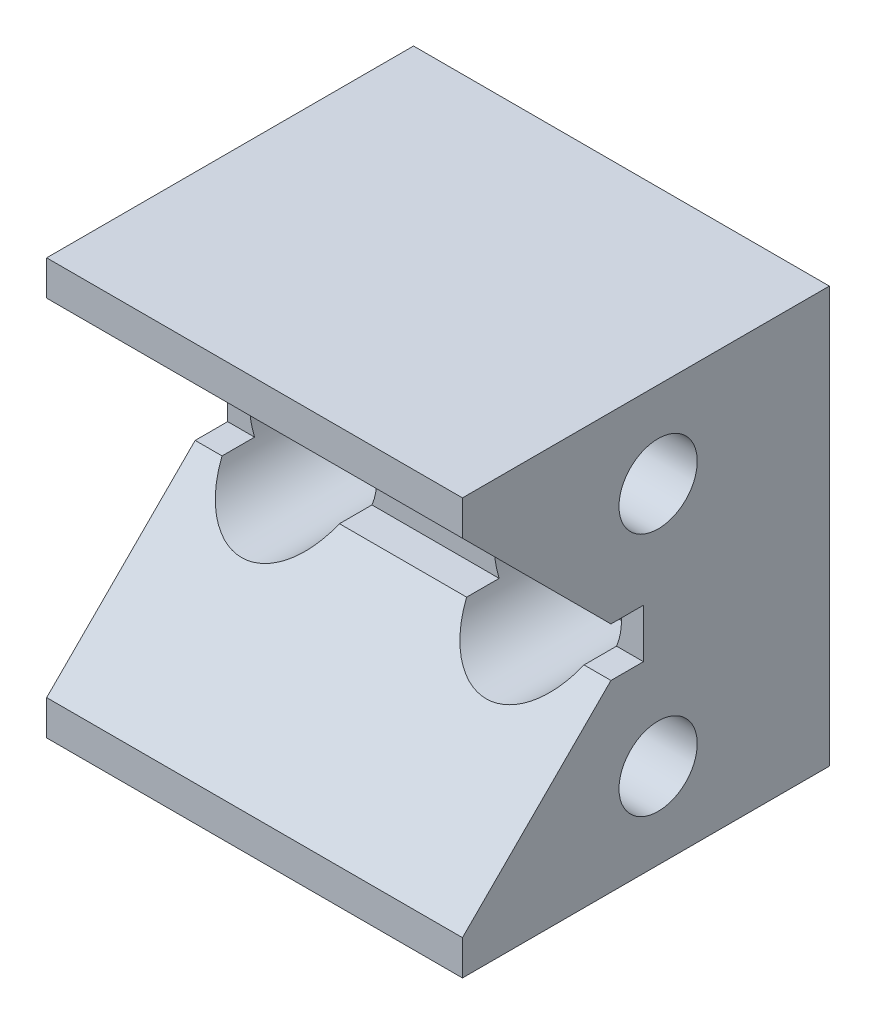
ISO-10303-21;
HEADER;
FILE_DESCRIPTION(('STEP AP214'),'2;1');
FILE_NAME('part.step','',(''),(''),'','','');
FILE_SCHEMA(('AUTOMOTIVE_DESIGN { 1 0 10303 214 1 1 1 1 }'));
ENDSEC;
DATA;
#1=APPLICATION_CONTEXT('core data for automotive mechanical design processes');
#2=APPLICATION_PROTOCOL_DEFINITION('international standard','automotive_design',2000,#1);
#3=PRODUCT_CONTEXT('',#1,'mechanical');
#4=PRODUCT('Part','Part','',(#3));
#5=PRODUCT_RELATED_PRODUCT_CATEGORY('part','',(#4));
#6=PRODUCT_DEFINITION_FORMATION('','',#4);
#7=PRODUCT_DEFINITION_CONTEXT('part definition',#1,'design');
#8=PRODUCT_DEFINITION('design','',#6,#7);
#9=PRODUCT_DEFINITION_SHAPE('','',#8);
#10=(LENGTH_UNIT() NAMED_UNIT(*) SI_UNIT(.MILLI.,.METRE.));
#11=(NAMED_UNIT(*) PLANE_ANGLE_UNIT() SI_UNIT($,.RADIAN.));
#12=(NAMED_UNIT(*) SI_UNIT($,.STERADIAN.) SOLID_ANGLE_UNIT());
#13=UNCERTAINTY_MEASURE_WITH_UNIT(LENGTH_MEASURE(1.E-05),#10,'distance_accuracy_value','');
#14=(GEOMETRIC_REPRESENTATION_CONTEXT(3) GLOBAL_UNCERTAINTY_ASSIGNED_CONTEXT((#13)) GLOBAL_UNIT_ASSIGNED_CONTEXT((#10,
#11,#12)) REPRESENTATION_CONTEXT('',''));
#15=CARTESIAN_POINT('',(0.,0.,0.));
#16=DIRECTION('',(0.,0.,1.));
#17=DIRECTION('',(1.,0.,0.));
#18=AXIS2_PLACEMENT_3D('',#15,#16,#17);
#19=CARTESIAN_POINT('',(67.5,-42.5,0.));
#20=DIRECTION('',(0.,0.,1.));
#21=DIRECTION('',(0.,-1.,0.));
#22=AXIS2_PLACEMENT_3D('',#19,#20,#21);
#23=PLANE('',#22);
#24=CARTESIAN_POINT('',(50.,0.,0.));
#25=DIRECTION('',(0.,0.,-1.));
#26=DIRECTION('',(0.,1.,0.));
#27=AXIS2_PLACEMENT_3D('',#24,#25,#26);
#28=CIRCLE('',#27,8.);
#29=CARTESIAN_POINT('',(50.,8.,0.));
#30=VERTEX_POINT('',#29);
#31=EDGE_CURVE('E336',#30,#30,#28,.T.);
#32=ORIENTED_EDGE('',*,*,#31,.F.);
#33=EDGE_LOOP('',(#32));
#34=FACE_BOUND('',#33,.T.);
#35=DIRECTION('',(-1.,0.,0.));
#36=VECTOR('',#35,1.);
#37=CARTESIAN_POINT('',(67.5,42.5,0.));
#38=LINE('',#37,#36);
#39=CARTESIAN_POINT('',(67.5,42.5,0.));
#40=VERTEX_POINT('',#39);
#41=CARTESIAN_POINT('',(-17.5,42.5,0.));
#42=VERTEX_POINT('',#41);
#43=EDGE_CURVE('E178',#40,#42,#38,.T.);
#44=ORIENTED_EDGE('',*,*,#43,.F.);
#45=DIRECTION('',(0.,1.,0.));
#46=VECTOR('',#45,1.);
#47=CARTESIAN_POINT('',(67.5,-42.5,0.));
#48=LINE('',#47,#46);
#49=CARTESIAN_POINT('',(67.5,-42.5,0.));
#50=VERTEX_POINT('',#49);
#51=EDGE_CURVE('E235',#50,#40,#48,.T.);
#52=ORIENTED_EDGE('',*,*,#51,.F.);
#53=DIRECTION('',(-1.,0.,0.));
#54=VECTOR('',#53,1.);
#55=CARTESIAN_POINT('',(67.5,-42.5,0.));
#56=LINE('',#55,#54);
#57=CARTESIAN_POINT('',(-17.5,-42.5,0.));
#58=VERTEX_POINT('',#57);
#59=EDGE_CURVE('E180',#50,#58,#56,.T.);
#60=ORIENTED_EDGE('',*,*,#59,.T.);
#61=DIRECTION('',(0.,1.,0.));
#62=VECTOR('',#61,1.);
#63=CARTESIAN_POINT('',(-17.5,-42.5,0.));
#64=LINE('',#63,#62);
#65=EDGE_CURVE('E207',#58,#42,#64,.T.);
#66=ORIENTED_EDGE('',*,*,#65,.T.);
#67=EDGE_LOOP('',(#44,#52,#60,#66));
#68=FACE_BOUND('',#67,.T.);
#69=CARTESIAN_POINT('',(0.,0.,0.));
#70=DIRECTION('',(0.,0.,-1.));
#71=DIRECTION('',(0.,1.,0.));
#72=AXIS2_PLACEMENT_3D('',#69,#70,#71);
#73=CIRCLE('',#72,8.);
#74=CARTESIAN_POINT('',(0.,8.,0.));
#75=VERTEX_POINT('',#74);
#76=EDGE_CURVE('E310',#75,#75,#73,.T.);
#77=ORIENTED_EDGE('',*,*,#76,.F.);
#78=EDGE_LOOP('',(#77));
#79=FACE_BOUND('',#78,.T.);
#80=ADVANCED_FACE('F14',(#34,#68,#79),#23,.F.);
#81=CARTESIAN_POINT('',(67.5,35.355,75.));
#82=DIRECTION('',(0.,0.707106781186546,-0.707106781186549));
#83=DIRECTION('',(0.,0.707106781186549,0.707106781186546));
#84=AXIS2_PLACEMENT_3D('',#81,#82,#83);
#85=PLANE('',#84);
#86=CARTESIAN_POINT('',(0.,0.,39.645));
#87=DIRECTION('',(0.,0.707106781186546,-0.707106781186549));
#88=DIRECTION('',(0.,-0.707106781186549,-0.707106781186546));
#89=AXIS2_PLACEMENT_3D('',#86,#87,#88);
#90=ELLIPSE('',#89,18.3847763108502,13.);
#91=CARTESIAN_POINT('',(12.,5.,44.645));
#92=VERTEX_POINT('',#91);
#93=CARTESIAN_POINT('',(-12.,5.,44.645));
#94=VERTEX_POINT('',#93);
#95=EDGE_CURVE('E334',#92,#94,#90,.F.);
#96=ORIENTED_EDGE('',*,*,#95,.F.);
#97=DIRECTION('',(-1.,0.,0.));
#98=VECTOR('',#97,1.);
#99=CARTESIAN_POINT('',(67.5,5.,44.645));
#100=LINE('',#99,#98);
#101=CARTESIAN_POINT('',(38.,5.,44.645));
#102=VERTEX_POINT('',#101);
#103=EDGE_CURVE('E174',#102,#92,#100,.T.);
#104=ORIENTED_EDGE('',*,*,#103,.F.);
#105=CARTESIAN_POINT('',(50.,0.,39.645));
#106=DIRECTION('',(0.,0.707106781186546,-0.707106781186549));
#107=DIRECTION('',(0.,-0.707106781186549,-0.707106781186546));
#108=AXIS2_PLACEMENT_3D('',#105,#106,#107);
#109=ELLIPSE('',#108,18.3847763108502,13.);
#110=CARTESIAN_POINT('',(62.,5.,44.645));
#111=VERTEX_POINT('',#110);
#112=EDGE_CURVE('E201',#111,#102,#109,.F.);
#113=ORIENTED_EDGE('',*,*,#112,.F.);
#114=CARTESIAN_POINT('',(67.5,5.,44.645));
#115=VERTEX_POINT('',#114);
#116=EDGE_CURVE('E170',#115,#111,#100,.T.);
#117=ORIENTED_EDGE('',*,*,#116,.F.);
#118=DIRECTION('',(0.,-0.707106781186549,-0.707106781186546));
#119=VECTOR('',#118,1.);
#120=CARTESIAN_POINT('',(67.5,35.355,75.));
#121=LINE('',#120,#119);
#122=CARTESIAN_POINT('',(67.5,35.355,75.));
#123=VERTEX_POINT('',#122);
#124=EDGE_CURVE('E244',#123,#115,#121,.T.);
#125=ORIENTED_EDGE('',*,*,#124,.F.);
#126=DIRECTION('',(-1.,0.,0.));
#127=VECTOR('',#126,1.);
#128=CARTESIAN_POINT('',(67.5,35.355,75.));
#129=LINE('',#128,#127);
#130=CARTESIAN_POINT('',(-17.5,35.355,75.));
#131=VERTEX_POINT('',#130);
#132=EDGE_CURVE('E173',#123,#131,#129,.T.);
#133=ORIENTED_EDGE('',*,*,#132,.T.);
#134=DIRECTION('',(0.,-0.707106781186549,-0.707106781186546));
#135=VECTOR('',#134,1.);
#136=CARTESIAN_POINT('',(-17.5,35.355,75.));
#137=LINE('',#136,#135);
#138=CARTESIAN_POINT('',(-17.5,5.,44.645));
#139=VERTEX_POINT('',#138);
#140=EDGE_CURVE('E221',#131,#139,#137,.T.);
#141=ORIENTED_EDGE('',*,*,#140,.T.);
#142=EDGE_CURVE('E168',#94,#139,#100,.T.);
#143=ORIENTED_EDGE('',*,*,#142,.F.);
#144=EDGE_LOOP('',(#96,#104,#113,#117,#125,#133,#141,#143));
#145=FACE_BOUND('',#144,.T.);
#146=ADVANCED_FACE('F289',(#145),#85,.F.);
#147=CARTESIAN_POINT('',(67.5,5.,38.));
#148=DIRECTION('',(0.,-1.,0.));
#149=DIRECTION('',(0.,0.,-1.));
#150=AXIS2_PLACEMENT_3D('',#147,#148,#149);
#151=PLANE('',#150);
#152=DIRECTION('',(-1.,0.,0.));
#153=VECTOR('',#152,1.);
#154=CARTESIAN_POINT('',(67.5,5.,38.));
#155=LINE('',#154,#153);
#156=CARTESIAN_POINT('',(-12.,5.,38.));
#157=VERTEX_POINT('',#156);
#158=CARTESIAN_POINT('',(-17.5,5.,38.));
#159=VERTEX_POINT('',#158);
#160=EDGE_CURVE('E164',#157,#159,#155,.T.);
#161=ORIENTED_EDGE('',*,*,#160,.F.);
#162=DIRECTION('',(0.,0.,-1.));
#163=VECTOR('',#162,1.);
#164=CARTESIAN_POINT('',(-12.,5.,0.));
#165=LINE('',#164,#163);
#166=EDGE_CURVE('E331',#157,#94,#165,.F.);
#167=ORIENTED_EDGE('',*,*,#166,.T.);
#168=ORIENTED_EDGE('',*,*,#142,.T.);
#169=DIRECTION('',(0.,0.,1.));
#170=VECTOR('',#169,1.);
#171=CARTESIAN_POINT('',(-17.5,5.,38.));
#172=LINE('',#171,#170);
#173=EDGE_CURVE('E224',#159,#139,#172,.T.);
#174=ORIENTED_EDGE('',*,*,#173,.F.);
#175=EDGE_LOOP('',(#161,#167,#168,#174));
#176=FACE_BOUND('',#175,.T.);
#177=ADVANCED_FACE('F379',(#176),#151,.T.);
#178=ORIENTED_EDGE('',*,*,#103,.T.);
#179=DIRECTION('',(0.,0.,-1.));
#180=VECTOR('',#179,1.);
#181=CARTESIAN_POINT('',(12.,5.,0.));
#182=LINE('',#181,#180);
#183=CARTESIAN_POINT('',(12.,5.,38.));
#184=VERTEX_POINT('',#183);
#185=EDGE_CURVE('E328',#92,#184,#182,.T.);
#186=ORIENTED_EDGE('',*,*,#185,.T.);
#187=CARTESIAN_POINT('',(38.,5.,38.));
#188=VERTEX_POINT('',#187);
#189=EDGE_CURVE('E169',#188,#184,#155,.T.);
#190=ORIENTED_EDGE('',*,*,#189,.F.);
#191=DIRECTION('',(0.,0.,-1.));
#192=VECTOR('',#191,1.);
#193=CARTESIAN_POINT('',(38.,5.,0.));
#194=LINE('',#193,#192);
#195=EDGE_CURVE('E278',#188,#102,#194,.F.);
#196=ORIENTED_EDGE('',*,*,#195,.T.);
#197=EDGE_LOOP('',(#178,#186,#190,#196));
#198=FACE_BOUND('',#197,.T.);
#199=ADVANCED_FACE('F377',(#198),#151,.T.);
#200=CARTESIAN_POINT('',(67.5,-5.,38.));
#201=DIRECTION('',(0.,0.,1.));
#202=DIRECTION('',(0.,-1.,0.));
#203=AXIS2_PLACEMENT_3D('',#200,#201,#202);
#204=PLANE('',#203);
#205=DIRECTION('',(-1.,0.,0.));
#206=VECTOR('',#205,1.);
#207=CARTESIAN_POINT('',(67.5,-5.,38.));
#208=LINE('',#207,#206);
#209=CARTESIAN_POINT('',(-12.,-5.00000000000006,38.));
#210=VERTEX_POINT('',#209);
#211=CARTESIAN_POINT('',(-17.5,-5.,38.));
#212=VERTEX_POINT('',#211);
#213=EDGE_CURVE('E156',#210,#212,#208,.T.);
#214=ORIENTED_EDGE('',*,*,#213,.F.);
#215=CARTESIAN_POINT('',(0.,0.,38.));
#216=DIRECTION('',(0.,0.,1.));
#217=DIRECTION('',(0.,-1.,0.));
#218=AXIS2_PLACEMENT_3D('',#215,#216,#217);
#219=CIRCLE('',#218,13.);
#220=EDGE_CURVE('E327',#210,#157,#219,.F.);
#221=ORIENTED_EDGE('',*,*,#220,.T.);
#222=ORIENTED_EDGE('',*,*,#160,.T.);
#223=DIRECTION('',(0.,1.,0.));
#224=VECTOR('',#223,1.);
#225=CARTESIAN_POINT('',(-17.5,-5.,38.));
#226=LINE('',#225,#224);
#227=EDGE_CURVE('E227',#212,#159,#226,.T.);
#228=ORIENTED_EDGE('',*,*,#227,.F.);
#229=EDGE_LOOP('',(#214,#221,#222,#228));
#230=FACE_BOUND('',#229,.T.);
#231=ADVANCED_FACE('F373',(#230),#204,.T.);
#232=ORIENTED_EDGE('',*,*,#189,.T.);
#233=CARTESIAN_POINT('',(12.,-5.00000000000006,38.));
#234=VERTEX_POINT('',#233);
#235=EDGE_CURVE('E149',#184,#234,#219,.F.);
#236=ORIENTED_EDGE('',*,*,#235,.T.);
#237=CARTESIAN_POINT('',(38.,-5.00000000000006,38.));
#238=VERTEX_POINT('',#237);
#239=EDGE_CURVE('E148',#238,#234,#208,.T.);
#240=ORIENTED_EDGE('',*,*,#239,.F.);
#241=CARTESIAN_POINT('',(50.,0.,38.));
#242=DIRECTION('',(0.,0.,1.));
#243=DIRECTION('',(0.,-1.,0.));
#244=AXIS2_PLACEMENT_3D('',#241,#242,#243);
#245=CIRCLE('',#244,13.);
#246=EDGE_CURVE('E270',#238,#188,#245,.F.);
#247=ORIENTED_EDGE('',*,*,#246,.T.);
#248=EDGE_LOOP('',(#232,#236,#240,#247));
#249=FACE_BOUND('',#248,.T.);
#250=ADVANCED_FACE('F376',(#249),#204,.T.);
#251=CARTESIAN_POINT('',(67.5,-5.,44.645));
#252=DIRECTION('',(0.,1.,0.));
#253=DIRECTION('',(0.,0.,1.));
#254=AXIS2_PLACEMENT_3D('',#251,#252,#253);
#255=PLANE('',#254);
#256=ORIENTED_EDGE('',*,*,#239,.T.);
#257=DIRECTION('',(0.,0.,-1.));
#258=VECTOR('',#257,1.);
#259=CARTESIAN_POINT('',(12.,-5.00000000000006,0.));
#260=LINE('',#259,#258);
#261=CARTESIAN_POINT('',(12.,-5.,44.645));
#262=VERTEX_POINT('',#261);
#263=EDGE_CURVE('E137',#234,#262,#260,.F.);
#264=ORIENTED_EDGE('',*,*,#263,.T.);
#265=DIRECTION('',(-1.,0.,0.));
#266=VECTOR('',#265,1.);
#267=CARTESIAN_POINT('',(67.5,-5.,44.645));
#268=LINE('',#267,#266);
#269=CARTESIAN_POINT('',(38.,-5.,44.645));
#270=VERTEX_POINT('',#269);
#271=EDGE_CURVE('E146',#270,#262,#268,.T.);
#272=ORIENTED_EDGE('',*,*,#271,.F.);
#273=DIRECTION('',(0.,0.,-1.));
#274=VECTOR('',#273,1.);
#275=CARTESIAN_POINT('',(38.,-5.00000000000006,0.));
#276=LINE('',#275,#274);
#277=EDGE_CURVE('E36',#270,#238,#276,.T.);
#278=ORIENTED_EDGE('',*,*,#277,.T.);
#279=EDGE_LOOP('',(#256,#264,#272,#278));
#280=FACE_BOUND('',#279,.T.);
#281=ADVANCED_FACE('F145',(#280),#255,.T.);
#282=CARTESIAN_POINT('',(-12.,-5.,44.645));
#283=VERTEX_POINT('',#282);
#284=CARTESIAN_POINT('',(-17.5,-5.,44.645));
#285=VERTEX_POINT('',#284);
#286=EDGE_CURVE('E154',#283,#285,#268,.T.);
#287=ORIENTED_EDGE('',*,*,#286,.F.);
#288=DIRECTION('',(0.,0.,-1.));
#289=VECTOR('',#288,1.);
#290=CARTESIAN_POINT('',(-12.,-5.00000000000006,0.));
#291=LINE('',#290,#289);
#292=EDGE_CURVE('E29',#283,#210,#291,.T.);
#293=ORIENTED_EDGE('',*,*,#292,.T.);
#294=ORIENTED_EDGE('',*,*,#213,.T.);
#295=DIRECTION('',(0.,0.,-1.));
#296=VECTOR('',#295,1.);
#297=CARTESIAN_POINT('',(-17.5,-5.,44.645));
#298=LINE('',#297,#296);
#299=EDGE_CURVE('E230',#285,#212,#298,.T.);
#300=ORIENTED_EDGE('',*,*,#299,.F.);
#301=EDGE_LOOP('',(#287,#293,#294,#300));
#302=FACE_BOUND('',#301,.T.);
#303=ADVANCED_FACE('F369',(#302),#255,.T.);
#304=CARTESIAN_POINT('',(67.5,-35.355,75.));
#305=DIRECTION('',(0.,0.707106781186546,0.707106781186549));
#306=DIRECTION('',(0.,-0.707106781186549,0.707106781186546));
#307=AXIS2_PLACEMENT_3D('',#304,#305,#306);
#308=PLANE('',#307);
#309=ORIENTED_EDGE('',*,*,#271,.T.);
#310=CARTESIAN_POINT('',(0.,0.,39.645));
#311=DIRECTION('',(0.,0.707106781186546,0.707106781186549));
#312=DIRECTION('',(0.,0.707106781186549,-0.707106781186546));
#313=AXIS2_PLACEMENT_3D('',#310,#311,#312);
#314=ELLIPSE('',#313,18.3847763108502,13.);
#315=EDGE_CURVE('E9',#262,#283,#314,.F.);
#316=ORIENTED_EDGE('',*,*,#315,.T.);
#317=ORIENTED_EDGE('',*,*,#286,.T.);
#318=DIRECTION('',(0.,0.707106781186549,-0.707106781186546));
#319=VECTOR('',#318,1.);
#320=CARTESIAN_POINT('',(-17.5,-35.355,75.));
#321=LINE('',#320,#319);
#322=CARTESIAN_POINT('',(-17.5,-35.355,75.));
#323=VERTEX_POINT('',#322);
#324=EDGE_CURVE('E200',#323,#285,#321,.T.);
#325=ORIENTED_EDGE('',*,*,#324,.F.);
#326=DIRECTION('',(-1.,0.,0.));
#327=VECTOR('',#326,1.);
#328=CARTESIAN_POINT('',(67.5,-35.355,75.));
#329=LINE('',#328,#327);
#330=CARTESIAN_POINT('',(67.5,-35.355,75.));
#331=VERTEX_POINT('',#330);
#332=EDGE_CURVE('E157',#331,#323,#329,.T.);
#333=ORIENTED_EDGE('',*,*,#332,.F.);
#334=DIRECTION('',(0.,0.707106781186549,-0.707106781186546));
#335=VECTOR('',#334,1.);
#336=CARTESIAN_POINT('',(67.5,-35.355,75.));
#337=LINE('',#336,#335);
#338=CARTESIAN_POINT('',(67.5,-5.,44.645));
#339=VERTEX_POINT('',#338);
#340=EDGE_CURVE('E210',#331,#339,#337,.T.);
#341=ORIENTED_EDGE('',*,*,#340,.T.);
#342=CARTESIAN_POINT('',(62.,-5.,44.645));
#343=VERTEX_POINT('',#342);
#344=EDGE_CURVE('E153',#339,#343,#268,.T.);
#345=ORIENTED_EDGE('',*,*,#344,.T.);
#346=CARTESIAN_POINT('',(50.,0.,39.645));
#347=DIRECTION('',(0.,0.707106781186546,0.707106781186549));
#348=DIRECTION('',(0.,0.707106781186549,-0.707106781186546));
#349=AXIS2_PLACEMENT_3D('',#346,#347,#348);
#350=ELLIPSE('',#349,18.3847763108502,13.);
#351=EDGE_CURVE('E22',#343,#270,#350,.F.);
#352=ORIENTED_EDGE('',*,*,#351,.T.);
#353=EDGE_LOOP('',(#309,#316,#317,#325,#333,#341,#345,#352));
#354=FACE_BOUND('',#353,.T.);
#355=ADVANCED_FACE('F151',(#354),#308,.T.);
#356=ORIENTED_EDGE('',*,*,#116,.T.);
#357=DIRECTION('',(0.,0.,-1.));
#358=VECTOR('',#357,1.);
#359=CARTESIAN_POINT('',(62.,5.,0.));
#360=LINE('',#359,#358);
#361=CARTESIAN_POINT('',(62.,5.,38.));
#362=VERTEX_POINT('',#361);
#363=EDGE_CURVE('E276',#111,#362,#360,.T.);
#364=ORIENTED_EDGE('',*,*,#363,.T.);
#365=CARTESIAN_POINT('',(67.5,5.,38.));
#366=VERTEX_POINT('',#365);
#367=EDGE_CURVE('E165',#366,#362,#155,.T.);
#368=ORIENTED_EDGE('',*,*,#367,.F.);
#369=DIRECTION('',(0.,0.,1.));
#370=VECTOR('',#369,1.);
#371=CARTESIAN_POINT('',(67.5,5.,38.));
#372=LINE('',#371,#370);
#373=EDGE_CURVE('E247',#366,#115,#372,.T.);
#374=ORIENTED_EDGE('',*,*,#373,.T.);
#375=EDGE_LOOP('',(#356,#364,#368,#374));
#376=FACE_BOUND('',#375,.T.);
#377=ADVANCED_FACE('F292',(#376),#151,.T.);
#378=ORIENTED_EDGE('',*,*,#367,.T.);
#379=CARTESIAN_POINT('',(62.,-5.00000000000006,38.));
#380=VERTEX_POINT('',#379);
#381=EDGE_CURVE('E268',#362,#380,#245,.F.);
#382=ORIENTED_EDGE('',*,*,#381,.T.);
#383=CARTESIAN_POINT('',(67.5,-5.,38.));
#384=VERTEX_POINT('',#383);
#385=EDGE_CURVE('E161',#384,#380,#208,.T.);
#386=ORIENTED_EDGE('',*,*,#385,.F.);
#387=DIRECTION('',(0.,1.,0.));
#388=VECTOR('',#387,1.);
#389=CARTESIAN_POINT('',(67.5,-5.,38.));
#390=LINE('',#389,#388);
#391=EDGE_CURVE('E250',#384,#366,#390,.T.);
#392=ORIENTED_EDGE('',*,*,#391,.T.);
#393=EDGE_LOOP('',(#378,#382,#386,#392));
#394=FACE_BOUND('',#393,.T.);
#395=ADVANCED_FACE('F372',(#394),#204,.T.);
#396=ORIENTED_EDGE('',*,*,#385,.T.);
#397=DIRECTION('',(0.,0.,-1.));
#398=VECTOR('',#397,1.);
#399=CARTESIAN_POINT('',(62.,-5.00000000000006,0.));
#400=LINE('',#399,#398);
#401=EDGE_CURVE('E266',#380,#343,#400,.F.);
#402=ORIENTED_EDGE('',*,*,#401,.T.);
#403=ORIENTED_EDGE('',*,*,#344,.F.);
#404=DIRECTION('',(0.,0.,-1.));
#405=VECTOR('',#404,1.);
#406=CARTESIAN_POINT('',(67.5,-5.,44.645));
#407=LINE('',#406,#405);
#408=EDGE_CURVE('E253',#339,#384,#407,.T.);
#409=ORIENTED_EDGE('',*,*,#408,.T.);
#410=EDGE_LOOP('',(#396,#402,#403,#409));
#411=FACE_BOUND('',#410,.T.);
#412=ADVANCED_FACE('F264',(#411),#255,.T.);
#413=CARTESIAN_POINT('',(67.5,-42.5,75.));
#414=DIRECTION('',(0.,0.,1.));
#415=DIRECTION('',(0.,-1.,0.));
#416=AXIS2_PLACEMENT_3D('',#413,#414,#415);
#417=PLANE('',#416);
#418=DIRECTION('',(-1.,0.,0.));
#419=VECTOR('',#418,1.);
#420=CARTESIAN_POINT('',(67.5,-42.5,75.));
#421=LINE('',#420,#419);
#422=CARTESIAN_POINT('',(67.5,-42.5,75.));
#423=VERTEX_POINT('',#422);
#424=CARTESIAN_POINT('',(-17.5,-42.5,75.));
#425=VERTEX_POINT('',#424);
#426=EDGE_CURVE('E182',#423,#425,#421,.T.);
#427=ORIENTED_EDGE('',*,*,#426,.F.);
#428=DIRECTION('',(0.,1.,0.));
#429=VECTOR('',#428,1.);
#430=CARTESIAN_POINT('',(67.5,-42.5,75.));
#431=LINE('',#430,#429);
#432=EDGE_CURVE('E208',#423,#331,#431,.T.);
#433=ORIENTED_EDGE('',*,*,#432,.T.);
#434=ORIENTED_EDGE('',*,*,#332,.T.);
#435=DIRECTION('',(0.,1.,0.));
#436=VECTOR('',#435,1.);
#437=CARTESIAN_POINT('',(-17.5,-42.5,75.));
#438=LINE('',#437,#436);
#439=EDGE_CURVE('E195',#425,#323,#438,.T.);
#440=ORIENTED_EDGE('',*,*,#439,.F.);
#441=EDGE_LOOP('',(#427,#433,#434,#440));
#442=FACE_BOUND('',#441,.T.);
#443=ADVANCED_FACE('F196',(#442),#417,.T.);
#444=CARTESIAN_POINT('',(67.5,-42.5,75.));
#445=DIRECTION('',(0.,1.,0.));
#446=DIRECTION('',(0.,0.,1.));
#447=AXIS2_PLACEMENT_3D('',#444,#445,#446);
#448=PLANE('',#447);
#449=ORIENTED_EDGE('',*,*,#59,.F.);
#450=DIRECTION('',(0.,0.,-1.));
#451=VECTOR('',#450,1.);
#452=CARTESIAN_POINT('',(67.5,-42.5,75.));
#453=LINE('',#452,#451);
#454=EDGE_CURVE('E190',#423,#50,#453,.T.);
#455=ORIENTED_EDGE('',*,*,#454,.F.);
#456=ORIENTED_EDGE('',*,*,#426,.T.);
#457=DIRECTION('',(0.,0.,-1.));
#458=VECTOR('',#457,1.);
#459=CARTESIAN_POINT('',(-17.5,-42.5,75.));
#460=LINE('',#459,#458);
#461=EDGE_CURVE('E188',#425,#58,#460,.T.);
#462=ORIENTED_EDGE('',*,*,#461,.T.);
#463=EDGE_LOOP('',(#449,#455,#456,#462));
#464=FACE_BOUND('',#463,.T.);
#465=ADVANCED_FACE('F16',(#464),#448,.F.);
#466=CARTESIAN_POINT('',(67.5,42.5,0.));
#467=DIRECTION('',(0.,-1.,0.));
#468=DIRECTION('',(0.,0.,-1.));
#469=AXIS2_PLACEMENT_3D('',#466,#467,#468);
#470=PLANE('',#469);
#471=DIRECTION('',(-1.,0.,0.));
#472=VECTOR('',#471,1.);
#473=CARTESIAN_POINT('',(67.5,42.5,75.));
#474=LINE('',#473,#472);
#475=CARTESIAN_POINT('',(67.5,42.5,75.));
#476=VERTEX_POINT('',#475);
#477=CARTESIAN_POINT('',(-17.5,42.5,75.));
#478=VERTEX_POINT('',#477);
#479=EDGE_CURVE('E176',#476,#478,#474,.T.);
#480=ORIENTED_EDGE('',*,*,#479,.F.);
#481=DIRECTION('',(0.,0.,1.));
#482=VECTOR('',#481,1.);
#483=CARTESIAN_POINT('',(67.5,42.5,0.));
#484=LINE('',#483,#482);
#485=EDGE_CURVE('E238',#40,#476,#484,.T.);
#486=ORIENTED_EDGE('',*,*,#485,.F.);
#487=ORIENTED_EDGE('',*,*,#43,.T.);
#488=DIRECTION('',(0.,0.,1.));
#489=VECTOR('',#488,1.);
#490=CARTESIAN_POINT('',(-17.5,42.5,0.));
#491=LINE('',#490,#489);
#492=EDGE_CURVE('E211',#42,#478,#491,.T.);
#493=ORIENTED_EDGE('',*,*,#492,.T.);
#494=EDGE_LOOP('',(#480,#486,#487,#493));
#495=FACE_BOUND('',#494,.T.);
#496=ADVANCED_FACE('F302',(#495),#470,.F.);
#497=CARTESIAN_POINT('',(67.5,42.5,75.));
#498=DIRECTION('',(0.,0.,-1.));
#499=DIRECTION('',(0.,1.,0.));
#500=AXIS2_PLACEMENT_3D('',#497,#498,#499);
#501=PLANE('',#500);
#502=ORIENTED_EDGE('',*,*,#132,.F.);
#503=DIRECTION('',(0.,-1.,0.));
#504=VECTOR('',#503,1.);
#505=CARTESIAN_POINT('',(67.5,42.5,75.));
#506=LINE('',#505,#504);
#507=EDGE_CURVE('E241',#476,#123,#506,.T.);
#508=ORIENTED_EDGE('',*,*,#507,.F.);
#509=ORIENTED_EDGE('',*,*,#479,.T.);
#510=DIRECTION('',(0.,-1.,0.));
#511=VECTOR('',#510,1.);
#512=CARTESIAN_POINT('',(-17.5,42.5,75.));
#513=LINE('',#512,#511);
#514=EDGE_CURVE('E218',#478,#131,#513,.T.);
#515=ORIENTED_EDGE('',*,*,#514,.T.);
#516=EDGE_LOOP('',(#502,#508,#509,#515));
#517=FACE_BOUND('',#516,.T.);
#518=ADVANCED_FACE('F299',(#517),#501,.F.);
#519=CARTESIAN_POINT('',(67.5,-42.5,75.));
#520=DIRECTION('',(-1.,0.,0.));
#521=DIRECTION('',(0.,0.,-1.));
#522=AXIS2_PLACEMENT_3D('',#519,#520,#521);
#523=PLANE('',#522);
#524=CARTESIAN_POINT('',(67.5,-25.,35.));
#525=DIRECTION('',(1.,0.,0.));
#526=DIRECTION('',(0.,0.,1.));
#527=AXIS2_PLACEMENT_3D('',#524,#525,#526);
#528=CIRCLE('',#527,8.);
#529=CARTESIAN_POINT('',(67.5,-25.,43.));
#530=VERTEX_POINT('',#529);
#531=EDGE_CURVE('E319',#530,#530,#528,.T.);
#532=ORIENTED_EDGE('',*,*,#531,.F.);
#533=EDGE_LOOP('',(#532));
#534=FACE_BOUND('',#533,.T.);
#535=CARTESIAN_POINT('',(67.5,25.,35.));
#536=DIRECTION('',(1.,0.,0.));
#537=DIRECTION('',(0.,0.,1.));
#538=AXIS2_PLACEMENT_3D('',#535,#536,#537);
#539=CIRCLE('',#538,8.);
#540=CARTESIAN_POINT('',(67.5,25.,43.));
#541=VERTEX_POINT('',#540);
#542=EDGE_CURVE('E313',#541,#541,#539,.T.);
#543=ORIENTED_EDGE('',*,*,#542,.F.);
#544=EDGE_LOOP('',(#543));
#545=FACE_BOUND('',#544,.T.);
#546=ORIENTED_EDGE('',*,*,#432,.F.);
#547=ORIENTED_EDGE('',*,*,#454,.T.);
#548=ORIENTED_EDGE('',*,*,#51,.T.);
#549=ORIENTED_EDGE('',*,*,#485,.T.);
#550=ORIENTED_EDGE('',*,*,#507,.T.);
#551=ORIENTED_EDGE('',*,*,#124,.T.);
#552=ORIENTED_EDGE('',*,*,#373,.F.);
#553=ORIENTED_EDGE('',*,*,#391,.F.);
#554=ORIENTED_EDGE('',*,*,#408,.F.);
#555=ORIENTED_EDGE('',*,*,#340,.F.);
#556=EDGE_LOOP('',(#546,#547,#548,#549,#550,#551,#552,#553,#554,#555));
#557=FACE_BOUND('',#556,.T.);
#558=ADVANCED_FACE('F261',(#534,#545,#557),#523,.F.);
#559=CARTESIAN_POINT('',(-17.5,-42.5,75.));
#560=DIRECTION('',(-1.,0.,0.));
#561=DIRECTION('',(0.,0.,-1.));
#562=AXIS2_PLACEMENT_3D('',#559,#560,#561);
#563=PLANE('',#562);
#564=ORIENTED_EDGE('',*,*,#439,.T.);
#565=ORIENTED_EDGE('',*,*,#324,.T.);
#566=ORIENTED_EDGE('',*,*,#299,.T.);
#567=ORIENTED_EDGE('',*,*,#227,.T.);
#568=ORIENTED_EDGE('',*,*,#173,.T.);
#569=ORIENTED_EDGE('',*,*,#140,.F.);
#570=ORIENTED_EDGE('',*,*,#514,.F.);
#571=ORIENTED_EDGE('',*,*,#492,.F.);
#572=ORIENTED_EDGE('',*,*,#65,.F.);
#573=ORIENTED_EDGE('',*,*,#461,.F.);
#574=EDGE_LOOP('',(#564,#565,#566,#567,#568,#569,#570,#571,#572,#573));
#575=FACE_BOUND('',#574,.T.);
#576=ADVANCED_FACE('F204',(#575),#563,.T.);
#577=CARTESIAN_POINT('',(50.,0.,0.));
#578=DIRECTION('',(0.,0.,-1.));
#579=DIRECTION('',(0.,1.,0.));
#580=AXIS2_PLACEMENT_3D('',#577,#578,#579);
#581=CYLINDRICAL_SURFACE('',#580,13.);
#582=CARTESIAN_POINT('',(50.,0.,25.));
#583=DIRECTION('',(0.,0.,-1.));
#584=DIRECTION('',(0.,1.,0.));
#585=AXIS2_PLACEMENT_3D('',#582,#583,#584);
#586=CIRCLE('',#585,13.);
#587=CARTESIAN_POINT('',(50.,13.,25.));
#588=VERTEX_POINT('',#587);
#589=EDGE_CURVE('E272',#588,#588,#586,.T.);
#590=ORIENTED_EDGE('',*,*,#589,.T.);
#591=EDGE_LOOP('',(#590));
#592=FACE_BOUND('',#591,.T.);
#593=ORIENTED_EDGE('',*,*,#112,.T.);
#594=ORIENTED_EDGE('',*,*,#195,.F.);
#595=ORIENTED_EDGE('',*,*,#246,.F.);
#596=ORIENTED_EDGE('',*,*,#277,.F.);
#597=ORIENTED_EDGE('',*,*,#351,.F.);
#598=ORIENTED_EDGE('',*,*,#401,.F.);
#599=ORIENTED_EDGE('',*,*,#381,.F.);
#600=ORIENTED_EDGE('',*,*,#363,.F.);
#601=EDGE_LOOP('',(#593,#594,#595,#596,#597,#598,#599,#600));
#602=FACE_BOUND('',#601,.T.);
#603=ADVANCED_FACE('F285',(#592,#602),#581,.F.);
#604=CARTESIAN_POINT('',(50.,-13.,25.));
#605=DIRECTION('',(0.,0.,1.));
#606=DIRECTION('',(0.,-1.,0.));
#607=AXIS2_PLACEMENT_3D('',#604,#605,#606);
#608=PLANE('',#607);
#609=CARTESIAN_POINT('',(50.,0.,25.));
#610=DIRECTION('',(0.,0.,-1.));
#611=DIRECTION('',(0.,1.,0.));
#612=AXIS2_PLACEMENT_3D('',#609,#610,#611);
#613=CIRCLE('',#612,8.);
#614=CARTESIAN_POINT('',(50.,8.,25.));
#615=VERTEX_POINT('',#614);
#616=EDGE_CURVE('E339',#615,#615,#613,.T.);
#617=ORIENTED_EDGE('',*,*,#616,.T.);
#618=EDGE_LOOP('',(#617));
#619=FACE_BOUND('',#618,.T.);
#620=ORIENTED_EDGE('',*,*,#589,.F.);
#621=EDGE_LOOP('',(#620));
#622=FACE_BOUND('',#621,.T.);
#623=ADVANCED_FACE('F345',(#619,#622),#608,.T.);
#624=CARTESIAN_POINT('',(50.,0.,0.));
#625=DIRECTION('',(0.,0.,-1.));
#626=DIRECTION('',(0.,1.,0.));
#627=AXIS2_PLACEMENT_3D('',#624,#625,#626);
#628=CYLINDRICAL_SURFACE('',#627,8.);
#629=ORIENTED_EDGE('',*,*,#31,.T.);
#630=EDGE_LOOP('',(#629));
#631=FACE_BOUND('',#630,.T.);
#632=ORIENTED_EDGE('',*,*,#616,.F.);
#633=EDGE_LOOP('',(#632));
#634=FACE_BOUND('',#633,.T.);
#635=ADVANCED_FACE('F347',(#631,#634),#628,.F.);
#636=CARTESIAN_POINT('',(0.,0.,0.));
#637=DIRECTION('',(0.,0.,-1.));
#638=DIRECTION('',(0.,1.,0.));
#639=AXIS2_PLACEMENT_3D('',#636,#637,#638);
#640=CYLINDRICAL_SURFACE('',#639,13.);
#641=CARTESIAN_POINT('',(0.,0.,25.));
#642=DIRECTION('',(0.,0.,-1.));
#643=DIRECTION('',(0.,1.,0.));
#644=AXIS2_PLACEMENT_3D('',#641,#642,#643);
#645=CIRCLE('',#644,13.);
#646=CARTESIAN_POINT('',(0.,13.,25.));
#647=VERTEX_POINT('',#646);
#648=EDGE_CURVE('E316',#647,#647,#645,.T.);
#649=ORIENTED_EDGE('',*,*,#648,.T.);
#650=EDGE_LOOP('',(#649));
#651=FACE_BOUND('',#650,.T.);
#652=ORIENTED_EDGE('',*,*,#95,.T.);
#653=ORIENTED_EDGE('',*,*,#166,.F.);
#654=ORIENTED_EDGE('',*,*,#220,.F.);
#655=ORIENTED_EDGE('',*,*,#292,.F.);
#656=ORIENTED_EDGE('',*,*,#315,.F.);
#657=ORIENTED_EDGE('',*,*,#263,.F.);
#658=ORIENTED_EDGE('',*,*,#235,.F.);
#659=ORIENTED_EDGE('',*,*,#185,.F.);
#660=EDGE_LOOP('',(#652,#653,#654,#655,#656,#657,#658,#659));
#661=FACE_BOUND('',#660,.T.);
#662=ADVANCED_FACE('F136',(#651,#661),#640,.F.);
#663=CARTESIAN_POINT('',(0.,-13.,25.));
#664=DIRECTION('',(0.,0.,1.));
#665=DIRECTION('',(0.,-1.,0.));
#666=AXIS2_PLACEMENT_3D('',#663,#664,#665);
#667=PLANE('',#666);
#668=CARTESIAN_POINT('',(0.,0.,25.));
#669=DIRECTION('',(0.,0.,-1.));
#670=DIRECTION('',(0.,1.,0.));
#671=AXIS2_PLACEMENT_3D('',#668,#669,#670);
#672=CIRCLE('',#671,8.);
#673=CARTESIAN_POINT('',(0.,8.,25.));
#674=VERTEX_POINT('',#673);
#675=EDGE_CURVE('E312',#674,#674,#672,.T.);
#676=ORIENTED_EDGE('',*,*,#675,.T.);
#677=EDGE_LOOP('',(#676));
#678=FACE_BOUND('',#677,.T.);
#679=ORIENTED_EDGE('',*,*,#648,.F.);
#680=EDGE_LOOP('',(#679));
#681=FACE_BOUND('',#680,.T.);
#682=ADVANCED_FACE('F529',(#678,#681),#667,.T.);
#683=CARTESIAN_POINT('',(0.,0.,0.));
#684=DIRECTION('',(0.,0.,-1.));
#685=DIRECTION('',(0.,1.,0.));
#686=AXIS2_PLACEMENT_3D('',#683,#684,#685);
#687=CYLINDRICAL_SURFACE('',#686,8.);
#688=ORIENTED_EDGE('',*,*,#76,.T.);
#689=EDGE_LOOP('',(#688));
#690=FACE_BOUND('',#689,.T.);
#691=ORIENTED_EDGE('',*,*,#675,.F.);
#692=EDGE_LOOP('',(#691));
#693=FACE_BOUND('',#692,.T.);
#694=ADVANCED_FACE('F537',(#690,#693),#687,.F.);
#695=CARTESIAN_POINT('',(37.5,25.,35.));
#696=DIRECTION('',(1.,0.,0.));
#697=DIRECTION('',(0.,0.,1.));
#698=AXIS2_PLACEMENT_3D('',#695,#696,#697);
#699=CYLINDRICAL_SURFACE('',#698,8.);
#700=ORIENTED_EDGE('',*,*,#542,.T.);
#701=EDGE_LOOP('',(#700));
#702=FACE_BOUND('',#701,.T.);
#703=CARTESIAN_POINT('',(32.5,25.,35.));
#704=DIRECTION('',(1.,0.,0.));
#705=DIRECTION('',(0.,0.,-1.));
#706=AXIS2_PLACEMENT_3D('',#703,#704,#705);
#707=CIRCLE('',#706,8.);
#708=CARTESIAN_POINT('',(32.5,25.,27.));
#709=VERTEX_POINT('',#708);
#710=EDGE_CURVE('E596',#709,#709,#707,.T.);
#711=ORIENTED_EDGE('',*,*,#710,.F.);
#712=EDGE_LOOP('',(#711));
#713=FACE_BOUND('',#712,.T.);
#714=ADVANCED_FACE('F546',(#702,#713),#699,.F.);
#715=CARTESIAN_POINT('',(37.5,-25.,35.));
#716=DIRECTION('',(1.,0.,0.));
#717=DIRECTION('',(0.,0.,1.));
#718=AXIS2_PLACEMENT_3D('',#715,#716,#717);
#719=CYLINDRICAL_SURFACE('',#718,8.);
#720=ORIENTED_EDGE('',*,*,#531,.T.);
#721=EDGE_LOOP('',(#720));
#722=FACE_BOUND('',#721,.T.);
#723=CARTESIAN_POINT('',(32.5,-25.,35.));
#724=DIRECTION('',(1.,0.,0.));
#725=DIRECTION('',(0.,0.,-1.));
#726=AXIS2_PLACEMENT_3D('',#723,#724,#725);
#727=CIRCLE('',#726,8.);
#728=CARTESIAN_POINT('',(32.5,-25.,27.));
#729=VERTEX_POINT('',#728);
#730=EDGE_CURVE('E594',#729,#729,#727,.T.);
#731=ORIENTED_EDGE('',*,*,#730,.F.);
#732=EDGE_LOOP('',(#731));
#733=FACE_BOUND('',#732,.T.);
#734=ADVANCED_FACE('F554',(#722,#733),#719,.F.);
#735=CARTESIAN_POINT('',(32.5,25.,35.));
#736=DIRECTION('',(1.,0.,0.));
#737=DIRECTION('',(0.,0.,-1.));
#738=AXIS2_PLACEMENT_3D('',#735,#736,#737);
#739=PLANE('',#738);
#740=ORIENTED_EDGE('',*,*,#710,.T.);
#741=EDGE_LOOP('',(#740));
#742=FACE_BOUND('',#741,.T.);
#743=ADVANCED_FACE('F563',(#742),#739,.T.);
#744=CARTESIAN_POINT('',(32.5,-25.,35.));
#745=DIRECTION('',(1.,0.,0.));
#746=DIRECTION('',(0.,0.,-1.));
#747=AXIS2_PLACEMENT_3D('',#744,#745,#746);
#748=PLANE('',#747);
#749=ORIENTED_EDGE('',*,*,#730,.T.);
#750=EDGE_LOOP('',(#749));
#751=FACE_BOUND('',#750,.T.);
#752=ADVANCED_FACE('F572',(#751),#748,.T.);
#753=CLOSED_SHELL('',(#80,#146,#177,#199,#231,#250,#281,#303,#355,#377,#395,#412,#443,#465,#496,
#518,#558,#576,#603,#623,#635,#662,#682,#694,#714,#734,#743,#752));
#754=MANIFOLD_SOLID_BREP('B1',#753);
#755=ADVANCED_BREP_SHAPE_REPRESENTATION('',(#18,#754),#14);
#756=SHAPE_DEFINITION_REPRESENTATION(#9,#755);
ENDSEC;
END-ISO-10303-21;
